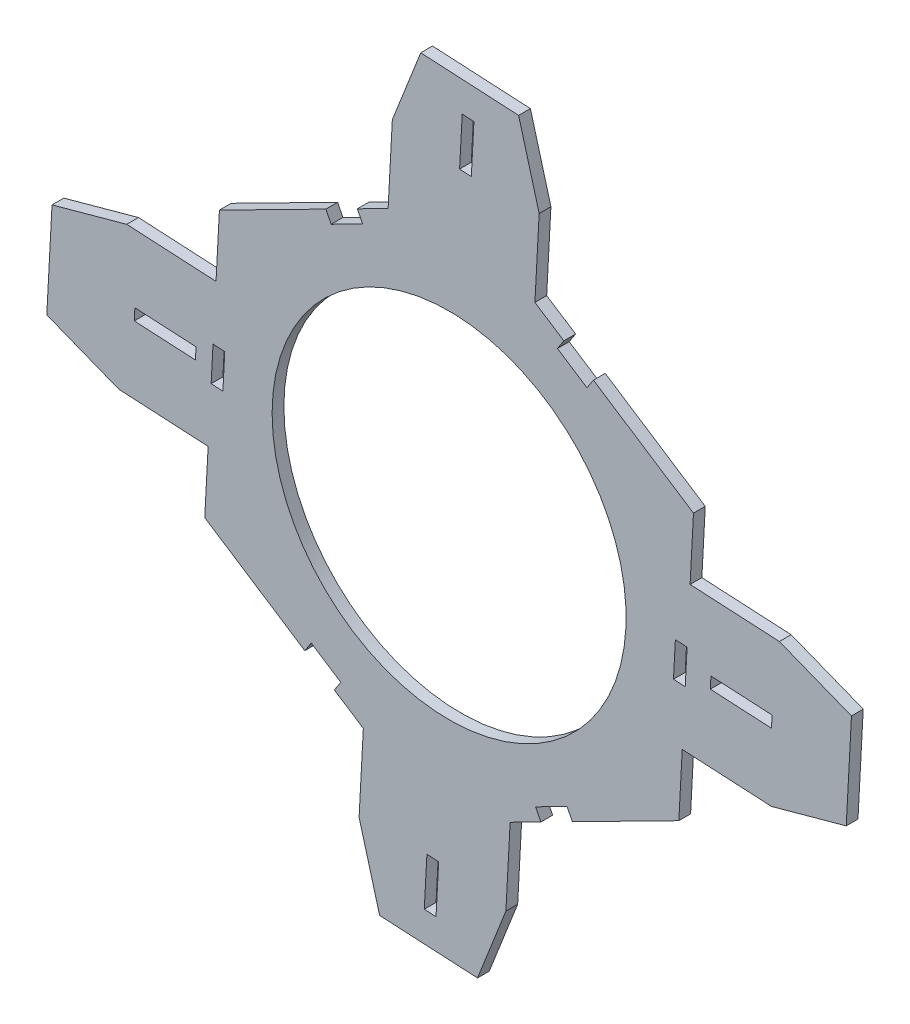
from build123d import *
from OCP.BRepFilletAPI import BRepFilletAPI_MakeChamfer

# Parameters (mm, degrees)
SKETCH1_R           = 22.936303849
BOSS_EXTRUDE1_DEPTH = 1.524
CHAMFER1_SIZE       = 9.525
CHAMFER1_SIZE2      = 3.175
CHAMFER2_SIZE       = 3.175
CHAMFER2_SIZE2      = 9.525
CUT_EXTRUDE1_DEPTH  = 2.54


with BuildPart() as part:
    # Sketch1 → Boss-Extrude1 (new body)
    with BuildSketch(Plane.XY):
        Polygon((81.681455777, 46.433435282), (100.704172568, 45.414246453), (99.645566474, 25.655823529), (103.394283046, 23.215157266), (102.562762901, 21.937992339), (106.394257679, 19.443431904), (107.225777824, 20.72059683), (120.19163832, 12.278950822), (119.75118043, 4.057995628), (140.830834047, 2.928601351), (139.811645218, -16.094115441), (118.731991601, -14.964721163), (118.291533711, -23.185676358), (104.49792357, -30.193617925), (103.807626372, -28.834917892), (99.731526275, -30.905809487), (100.421823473, -32.264509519), (96.433786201, -34.290660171), (95.375180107, -54.049083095), (76.352463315, -53.029894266), (77.411069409, -33.271471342), (73.662352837, -30.830805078), (74.493872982, -29.553640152), (70.662378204, -27.059079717), (69.830858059, -28.336244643), (56.864997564, -19.894598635), (57.305455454, -11.673643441), (36.225801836, -10.544249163), (37.244990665, 8.478467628), (58.324644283, 7.349073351), (58.765102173, 15.570028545), (72.558712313, 22.577970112), (73.249009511, 21.219270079), (77.325109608, 23.290161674), (76.63481241, 24.648861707), (80.622849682, 26.675012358), align=None)
        with Locations(Location((88.528317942, -3.807823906, 0), (0, 0, 180))):
            Circle(SKETCH1_R, mode=Mode.SUBTRACT)
        Polygon((57.937352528, 0.12044097), (57.692747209, -4.44501106), (59.214564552, -4.526546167), (59.459169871, 0.038905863), align=None, mode=Mode.SUBTRACT)
        Polygon((119.119283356, -7.736088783), (119.363888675, -3.170636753), (117.842071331, -3.089101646), (117.597466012, -7.654553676), align=None, mode=Mode.SUBTRACT)
    extrude(amount=BOSS_EXTRUDE1_DEPTH)

    # Chamfer1: one chamfer whose edges measure the first distance from different faces: ONE call of the kernel's chamfer builder (chamfer() names one face for all edges)
    chamfer1_edges_1 = [part.edges().sort_by_distance(p)[0] for p in [
        (37.244990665, 8.478467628, 0.762),
    ]]
    chamfer1_side_1 = [part.faces().sort_by_distance(p)[0] for p in [
        (47.784817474, 7.913770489, 0.762),
    ]]
    chamfer1_edges_2 = [part.edges().sort_by_distance(p)[0] for p in [
        (100.704172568, 45.414246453, 0.762),
    ]]
    chamfer1_side_2 = [part.faces().sort_by_distance(p)[0] for p in [
        (100.174869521, 35.535034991, 0.762),
    ]]
    chamfer1_edges_3 = [part.edges().sort_by_distance(p)[0] for p in [
        (139.811645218, -16.094115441, 0.762),
    ]]
    chamfer1_side_3 = [part.faces().sort_by_distance(p)[0] for p in [
        (129.27181841, -15.529418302, 0.762),
    ]]
    chamfer1_edges_4 = [part.edges().sort_by_distance(p)[0] for p in [
        (76.352463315, -53.029894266, 0.762),
    ]]
    chamfer1_side_4 = [part.faces().sort_by_distance(p)[0] for p in [
        (76.881766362, -43.150682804, 0.762),
    ]]
    chamfer1 = BRepFilletAPI_MakeChamfer(part.part.solid().wrapped)
    for e in chamfer1_edges_1:
        chamfer1.Add(CHAMFER1_SIZE, CHAMFER1_SIZE2, e.wrapped, chamfer1_side_1[0].wrapped)  # the first distance lies on this face
    for e in chamfer1_edges_2:
        chamfer1.Add(CHAMFER1_SIZE, CHAMFER1_SIZE2, e.wrapped, chamfer1_side_2[0].wrapped)  # the first distance lies on this face
    for e in chamfer1_edges_3:
        chamfer1.Add(CHAMFER1_SIZE, CHAMFER1_SIZE2, e.wrapped, chamfer1_side_3[0].wrapped)  # the first distance lies on this face
    for e in chamfer1_edges_4:
        chamfer1.Add(CHAMFER1_SIZE, CHAMFER1_SIZE2, e.wrapped, chamfer1_side_4[0].wrapped)  # the first distance lies on this face
    add(Compound.cast(chamfer1.Shape()), mode=Mode.REPLACE)

    # Chamfer2: one chamfer whose edges measure the first distance from different faces: ONE call of the kernel's chamfer builder (chamfer() names one face for all edges)
    chamfer2_edges_1 = [part.edges().sort_by_distance(p)[0] for p in [
        (36.225801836, -10.544249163, 0.762),
    ]]
    chamfer2_side_1 = [part.faces().sort_by_distance(p)[0] for p in [
        (36.650463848, -2.618117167, 0.762),
    ]]
    chamfer2_edges_2 = [part.edges().sort_by_distance(p)[0] for p in [
        (81.681455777, 46.433435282, 0.762),
    ]]
    chamfer2_side_2 = [part.faces().sort_by_distance(p)[0] for p in [
        (89.607587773, 46.00877327, 0.762),
    ]]
    chamfer2_edges_3 = [part.edges().sort_by_distance(p)[0] for p in [
        (140.830834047, 2.928601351, 0.762),
    ]]
    chamfer2_side_3 = [part.faces().sort_by_distance(p)[0] for p in [
        (140.406172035, -4.997530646, 0.762),
    ]]
    chamfer2_edges_4 = [part.edges().sort_by_distance(p)[0] for p in [
        (95.375180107, -54.049083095, 0.762),
    ]]
    chamfer2_side_4 = [part.faces().sort_by_distance(p)[0] for p in [
        (87.44904811, -53.624421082, 0.762),
    ]]
    chamfer2 = BRepFilletAPI_MakeChamfer(part.part.solid().wrapped)
    for e in chamfer2_edges_1:
        chamfer2.Add(CHAMFER2_SIZE, CHAMFER2_SIZE2, e.wrapped, chamfer2_side_1[0].wrapped)  # the first distance lies on this face
    for e in chamfer2_edges_2:
        chamfer2.Add(CHAMFER2_SIZE, CHAMFER2_SIZE2, e.wrapped, chamfer2_side_2[0].wrapped)  # the first distance lies on this face
    for e in chamfer2_edges_3:
        chamfer2.Add(CHAMFER2_SIZE, CHAMFER2_SIZE2, e.wrapped, chamfer2_side_3[0].wrapped)  # the first distance lies on this face
    for e in chamfer2_edges_4:
        chamfer2.Add(CHAMFER2_SIZE, CHAMFER2_SIZE2, e.wrapped, chamfer2_side_4[0].wrapped)  # the first distance lies on this face
    add(Compound.cast(chamfer2.Shape()), mode=Mode.REPLACE)

    # Sketch4 → Cut-Extrude1 (cut)
    with BuildSketch(Plane.XY.offset(1.524)):
        Polygon((91.405442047, 35.64965039), (91.745171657, 41.990555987), (90.223354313, 42.072091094), (89.883624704, 35.731185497), align=None)
        Polygon((122.371271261, -6.384136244), (130.297403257, -6.808798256), (130.378938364, -5.286980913), (122.452806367, -4.862318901), align=None)
        Polygon((85.651193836, -43.265298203), (85.311464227, -49.6062038), (86.83328157, -49.687738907), (87.17301118, -43.346833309), align=None)
        Polygon((55.738296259, -1.28792497), (47.812164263, -0.863262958), (47.730629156, -2.385080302), (55.656761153, -2.809742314), align=None)
    extrude(amount=-CUT_EXTRUDE1_DEPTH, mode=Mode.SUBTRACT)


solid = part.part
